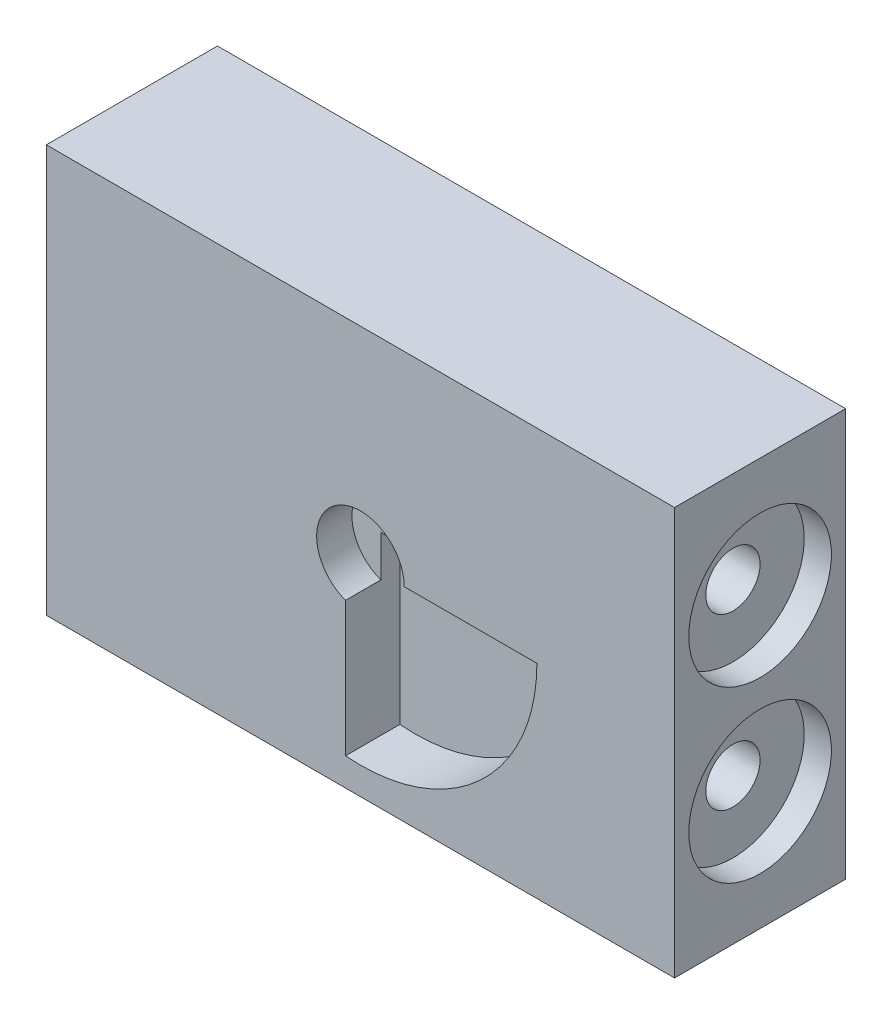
ISO-10303-21;
HEADER;
FILE_DESCRIPTION(('STEP AP214'),'2;1');
FILE_NAME('part.step','',(''),(''),'','','');
FILE_SCHEMA(('AUTOMOTIVE_DESIGN { 1 0 10303 214 1 1 1 1 }'));
ENDSEC;
DATA;
#1=APPLICATION_CONTEXT('core data for automotive mechanical design processes');
#2=APPLICATION_PROTOCOL_DEFINITION('international standard','automotive_design',2000,#1);
#3=PRODUCT_CONTEXT('',#1,'mechanical');
#4=PRODUCT('Part','Part','',(#3));
#5=PRODUCT_RELATED_PRODUCT_CATEGORY('part','',(#4));
#6=PRODUCT_DEFINITION_FORMATION('','',#4);
#7=PRODUCT_DEFINITION_CONTEXT('part definition',#1,'design');
#8=PRODUCT_DEFINITION('design','',#6,#7);
#9=PRODUCT_DEFINITION_SHAPE('','',#8);
#10=(LENGTH_UNIT() NAMED_UNIT(*) SI_UNIT(.MILLI.,.METRE.));
#11=(NAMED_UNIT(*) PLANE_ANGLE_UNIT() SI_UNIT($,.RADIAN.));
#12=(NAMED_UNIT(*) SI_UNIT($,.STERADIAN.) SOLID_ANGLE_UNIT());
#13=UNCERTAINTY_MEASURE_WITH_UNIT(LENGTH_MEASURE(1.E-05),#10,'distance_accuracy_value','');
#14=(GEOMETRIC_REPRESENTATION_CONTEXT(3) GLOBAL_UNCERTAINTY_ASSIGNED_CONTEXT((#13)) GLOBAL_UNIT_ASSIGNED_CONTEXT((#10,
#11,#12)) REPRESENTATION_CONTEXT('',''));
#15=CARTESIAN_POINT('',(0.,0.,0.));
#16=DIRECTION('',(0.,0.,1.));
#17=DIRECTION('',(1.,0.,0.));
#18=AXIS2_PLACEMENT_3D('',#15,#16,#17);
#19=CARTESIAN_POINT('',(29.5275,-16.3368181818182,0.));
#20=DIRECTION('',(1.,0.,0.));
#21=DIRECTION('',(0.,0.,-1.));
#22=AXIS2_PLACEMENT_3D('',#19,#20,#21);
#23=PLANE('',#22);
#24=CARTESIAN_POINT('',(29.5275,-15.875,0.));
#25=DIRECTION('',(-1.,0.,0.));
#26=DIRECTION('',(0.,0.,1.));
#27=AXIS2_PLACEMENT_3D('',#24,#25,#26);
#28=CIRCLE('',#27,5.08);
#29=CARTESIAN_POINT('',(29.5275,-15.875,5.08));
#30=VERTEX_POINT('',#29);
#31=EDGE_CURVE('E221',#30,#30,#28,.F.);
#32=ORIENTED_EDGE('',*,*,#31,.T.);
#33=EDGE_LOOP('',(#32));
#34=FACE_BOUND('',#33,.T.);
#35=ADVANCED_FACE('F34',(#34),#23,.T.);
#36=CARTESIAN_POINT('',(29.5275,15.4131818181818,0.));
#37=DIRECTION('',(1.,0.,0.));
#38=DIRECTION('',(0.,0.,-1.));
#39=AXIS2_PLACEMENT_3D('',#36,#37,#38);
#40=PLANE('',#39);
#41=CARTESIAN_POINT('',(29.5275,15.875,0.));
#42=DIRECTION('',(-1.,0.,0.));
#43=DIRECTION('',(0.,0.,1.));
#44=AXIS2_PLACEMENT_3D('',#41,#42,#43);
#45=CIRCLE('',#44,5.08);
#46=CARTESIAN_POINT('',(29.5275,15.875,5.08000000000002));
#47=VERTEX_POINT('',#46);
#48=EDGE_CURVE('E218',#47,#47,#45,.F.);
#49=ORIENTED_EDGE('',*,*,#48,.T.);
#50=EDGE_LOOP('',(#49));
#51=FACE_BOUND('',#50,.T.);
#52=ADVANCED_FACE('F608',(#51),#40,.T.);
#53=CARTESIAN_POINT('',(53.6575,-15.875,0.));
#54=DIRECTION('',(-1.,0.,0.));
#55=DIRECTION('',(0.,0.,1.));
#56=AXIS2_PLACEMENT_3D('',#53,#54,#55);
#57=CYLINDRICAL_SURFACE('',#56,5.08);
#58=CARTESIAN_POINT('',(53.6575,-15.875,0.));
#59=DIRECTION('',(-1.,0.,0.));
#60=DIRECTION('',(0.,0.,1.));
#61=AXIS2_PLACEMENT_3D('',#58,#59,#60);
#62=CIRCLE('',#61,5.08);
#63=CARTESIAN_POINT('',(53.6575,-15.875,5.08));
#64=VERTEX_POINT('',#63);
#65=EDGE_CURVE('E215',#64,#64,#62,.T.);
#66=ORIENTED_EDGE('',*,*,#65,.F.);
#67=EDGE_LOOP('',(#66));
#68=FACE_BOUND('',#67,.T.);
#69=ORIENTED_EDGE('',*,*,#31,.F.);
#70=EDGE_LOOP('',(#69));
#71=FACE_BOUND('',#70,.T.);
#72=ADVANCED_FACE('F618',(#68,#71),#57,.F.);
#73=CARTESIAN_POINT('',(53.6575,15.875,0.));
#74=DIRECTION('',(-1.,0.,0.));
#75=DIRECTION('',(0.,0.,1.));
#76=AXIS2_PLACEMENT_3D('',#73,#74,#75);
#77=CYLINDRICAL_SURFACE('',#76,5.08);
#78=CARTESIAN_POINT('',(53.6575,15.875,0.));
#79=DIRECTION('',(-1.,0.,0.));
#80=DIRECTION('',(0.,0.,1.));
#81=AXIS2_PLACEMENT_3D('',#78,#79,#80);
#82=CIRCLE('',#81,5.08);
#83=CARTESIAN_POINT('',(53.6575,15.875,5.08000000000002));
#84=VERTEX_POINT('',#83);
#85=EDGE_CURVE('E212',#84,#84,#82,.T.);
#86=ORIENTED_EDGE('',*,*,#85,.F.);
#87=EDGE_LOOP('',(#86));
#88=FACE_BOUND('',#87,.T.);
#89=ORIENTED_EDGE('',*,*,#48,.F.);
#90=EDGE_LOOP('',(#89));
#91=FACE_BOUND('',#90,.T.);
#92=ADVANCED_FACE('F628',(#88,#91),#77,.F.);
#93=CARTESIAN_POINT('',(-32.0397909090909,0.,-6.35));
#94=DIRECTION('',(0.,0.,1.));
#95=DIRECTION('',(1.,0.,0.));
#96=AXIS2_PLACEMENT_3D('',#93,#94,#95);
#97=PLANE('',#96);
#98=CARTESIAN_POINT('',(-31.75,0.,-6.35));
#99=DIRECTION('',(0.,0.,1.));
#100=DIRECTION('',(1.,0.,0.));
#101=AXIS2_PLACEMENT_3D('',#98,#99,#100);
#102=CIRCLE('',#101,3.1877);
#103=CARTESIAN_POINT('',(-28.5623,0.,-6.35));
#104=VERTEX_POINT('',#103);
#105=EDGE_CURVE('E209',#104,#104,#102,.F.);
#106=ORIENTED_EDGE('',*,*,#105,.T.);
#107=EDGE_LOOP('',(#106));
#108=FACE_BOUND('',#107,.T.);
#109=ADVANCED_FACE('F638',(#108),#97,.F.);
#110=CARTESIAN_POINT('',(32.0386363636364,-31.75,-5.08));
#111=DIRECTION('',(0.,0.,1.));
#112=DIRECTION('',(1.,0.,0.));
#113=AXIS2_PLACEMENT_3D('',#110,#111,#112);
#114=PLANE('',#113);
#115=CARTESIAN_POINT('',(31.75,-31.75,-5.08));
#116=DIRECTION('',(0.,0.,1.));
#117=DIRECTION('',(1.,0.,0.));
#118=AXIS2_PLACEMENT_3D('',#115,#116,#117);
#119=CIRCLE('',#118,3.175);
#120=CARTESIAN_POINT('',(34.925,-31.75,-5.08));
#121=VERTEX_POINT('',#120);
#122=EDGE_CURVE('E206',#121,#121,#119,.F.);
#123=ORIENTED_EDGE('',*,*,#122,.T.);
#124=EDGE_LOOP('',(#123));
#125=FACE_BOUND('',#124,.T.);
#126=ADVANCED_FACE('F343',(#125),#114,.F.);
#127=CARTESIAN_POINT('',(28.575,28.5115,-5.08));
#128=DIRECTION('',(0.,0.,1.));
#129=DIRECTION('',(1.,0.,0.));
#130=AXIS2_PLACEMENT_3D('',#127,#128,#129);
#131=PLANE('',#130);
#132=CARTESIAN_POINT('',(31.75,31.75,-5.08));
#133=DIRECTION('',(0.,0.,1.));
#134=DIRECTION('',(1.,0.,0.));
#135=AXIS2_PLACEMENT_3D('',#132,#133,#134);
#136=CIRCLE('',#135,3.175);
#137=CARTESIAN_POINT('',(34.925,31.75,-5.08));
#138=VERTEX_POINT('',#137);
#139=EDGE_CURVE('E203',#138,#138,#136,.F.);
#140=ORIENTED_EDGE('',*,*,#139,.T.);
#141=EDGE_LOOP('',(#140));
#142=FACE_BOUND('',#141,.T.);
#143=ADVANCED_FACE('F339',(#142),#131,.F.);
#144=CARTESIAN_POINT('',(32.0397909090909,0.,-6.35));
#145=DIRECTION('',(0.,0.,1.));
#146=DIRECTION('',(1.,0.,0.));
#147=AXIS2_PLACEMENT_3D('',#144,#145,#146);
#148=PLANE('',#147);
#149=CARTESIAN_POINT('',(31.75,0.,-6.35));
#150=DIRECTION('',(0.,0.,1.));
#151=DIRECTION('',(1.,0.,0.));
#152=AXIS2_PLACEMENT_3D('',#149,#150,#151);
#153=CIRCLE('',#152,3.1877);
#154=CARTESIAN_POINT('',(34.9377,0.,-6.35));
#155=VERTEX_POINT('',#154);
#156=EDGE_CURVE('E200',#155,#155,#153,.F.);
#157=ORIENTED_EDGE('',*,*,#156,.T.);
#158=EDGE_LOOP('',(#157));
#159=FACE_BOUND('',#158,.T.);
#160=ADVANCED_FACE('F342',(#159),#148,.F.);
#161=CARTESIAN_POINT('',(-28.575,-28.5115,-5.08));
#162=DIRECTION('',(0.,0.,1.));
#163=DIRECTION('',(-1.,0.,0.));
#164=AXIS2_PLACEMENT_3D('',#161,#162,#163);
#165=PLANE('',#164);
#166=CARTESIAN_POINT('',(-31.75,-31.75,-5.08));
#167=DIRECTION('',(0.,0.,1.));
#168=DIRECTION('',(1.,0.,0.));
#169=AXIS2_PLACEMENT_3D('',#166,#167,#168);
#170=CIRCLE('',#169,3.175);
#171=CARTESIAN_POINT('',(-28.575,-31.75,-5.08));
#172=VERTEX_POINT('',#171);
#173=EDGE_CURVE('E197',#172,#172,#170,.F.);
#174=ORIENTED_EDGE('',*,*,#173,.T.);
#175=EDGE_LOOP('',(#174));
#176=FACE_BOUND('',#175,.T.);
#177=ADVANCED_FACE('F345',(#176),#165,.F.);
#178=CARTESIAN_POINT('',(-32.0386363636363,31.75,-5.08));
#179=DIRECTION('',(0.,0.,1.));
#180=DIRECTION('',(1.,0.,0.));
#181=AXIS2_PLACEMENT_3D('',#178,#179,#180);
#182=PLANE('',#181);
#183=CARTESIAN_POINT('',(-31.75,31.75,-5.08));
#184=DIRECTION('',(0.,0.,1.));
#185=DIRECTION('',(1.,0.,0.));
#186=AXIS2_PLACEMENT_3D('',#183,#184,#185);
#187=CIRCLE('',#186,3.175);
#188=CARTESIAN_POINT('',(-28.575,31.75,-5.08));
#189=VERTEX_POINT('',#188);
#190=EDGE_CURVE('E194',#189,#189,#187,.F.);
#191=ORIENTED_EDGE('',*,*,#190,.T.);
#192=EDGE_LOOP('',(#191));
#193=FACE_BOUND('',#192,.T.);
#194=ADVANCED_FACE('F348',(#193),#182,.F.);
#195=CARTESIAN_POINT('',(53.6575,-17.0872727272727,0.));
#196=DIRECTION('',(1.,0.,0.));
#197=DIRECTION('',(0.,0.,-1.));
#198=AXIS2_PLACEMENT_3D('',#195,#196,#197);
#199=PLANE('',#198);
#200=ORIENTED_EDGE('',*,*,#65,.T.);
#201=EDGE_LOOP('',(#200));
#202=FACE_BOUND('',#201,.T.);
#203=CARTESIAN_POINT('',(53.6575,-15.875,0.));
#204=DIRECTION('',(-1.,0.,0.));
#205=DIRECTION('',(0.,0.,1.));
#206=AXIS2_PLACEMENT_3D('',#203,#204,#205);
#207=CIRCLE('',#206,13.335);
#208=CARTESIAN_POINT('',(53.6575,-15.875,13.335));
#209=VERTEX_POINT('',#208);
#210=EDGE_CURVE('E191',#209,#209,#207,.F.);
#211=ORIENTED_EDGE('',*,*,#210,.T.);
#212=EDGE_LOOP('',(#211));
#213=FACE_BOUND('',#212,.T.);
#214=ADVANCED_FACE('F672',(#202,#213),#199,.T.);
#215=CARTESIAN_POINT('',(53.6575,14.6627272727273,0.));
#216=DIRECTION('',(1.,0.,0.));
#217=DIRECTION('',(0.,0.,-1.));
#218=AXIS2_PLACEMENT_3D('',#215,#216,#217);
#219=PLANE('',#218);
#220=ORIENTED_EDGE('',*,*,#85,.T.);
#221=EDGE_LOOP('',(#220));
#222=FACE_BOUND('',#221,.T.);
#223=CARTESIAN_POINT('',(53.6575,15.875,0.));
#224=DIRECTION('',(-1.,0.,0.));
#225=DIRECTION('',(0.,0.,1.));
#226=AXIS2_PLACEMENT_3D('',#223,#224,#225);
#227=CIRCLE('',#226,13.335);
#228=CARTESIAN_POINT('',(53.6575,15.875,13.335));
#229=VERTEX_POINT('',#228);
#230=EDGE_CURVE('E188',#229,#229,#227,.F.);
#231=ORIENTED_EDGE('',*,*,#230,.T.);
#232=EDGE_LOOP('',(#231));
#233=FACE_BOUND('',#232,.T.);
#234=ADVANCED_FACE('F682',(#222,#233),#219,.T.);
#235=CARTESIAN_POINT('',(-56.7375,-18.5963723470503,0.));
#236=DIRECTION('',(1.,0.,0.));
#237=DIRECTION('',(0.,0.,-1.));
#238=AXIS2_PLACEMENT_3D('',#235,#236,#237);
#239=PLANE('',#238);
#240=CARTESIAN_POINT('',(-56.7375,-19.05,0.));
#241=DIRECTION('',(1.,0.,0.));
#242=DIRECTION('',(0.,0.,-1.));
#243=AXIS2_PLACEMENT_3D('',#240,#241,#242);
#244=CIRCLE('',#243,4.9899041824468);
#245=CARTESIAN_POINT('',(-56.7375,-19.05,-4.9899041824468));
#246=VERTEX_POINT('',#245);
#247=EDGE_CURVE('E185',#246,#246,#244,.F.);
#248=ORIENTED_EDGE('',*,*,#247,.T.);
#249=EDGE_LOOP('',(#248));
#250=FACE_BOUND('',#249,.T.);
#251=ADVANCED_FACE('F692',(#250),#239,.F.);
#252=CARTESIAN_POINT('',(-55.6895,6.75409090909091,0.));
#253=DIRECTION('',(1.,0.,0.));
#254=DIRECTION('',(0.,0.,-1.));
#255=AXIS2_PLACEMENT_3D('',#252,#253,#254);
#256=PLANE('',#255);
#257=CARTESIAN_POINT('',(-55.6895,7.11200000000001,0.));
#258=DIRECTION('',(-1.,0.,0.));
#259=DIRECTION('',(0.,0.,1.));
#260=AXIS2_PLACEMENT_3D('',#257,#258,#259);
#261=CIRCLE('',#260,3.937);
#262=CARTESIAN_POINT('',(-55.6895,7.11200000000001,3.937));
#263=VERTEX_POINT('',#262);
#264=EDGE_CURVE('E182',#263,#263,#261,.T.);
#265=ORIENTED_EDGE('',*,*,#264,.T.);
#266=EDGE_LOOP('',(#265));
#267=FACE_BOUND('',#266,.T.);
#268=ADVANCED_FACE('F702',(#267),#256,.F.);
#269=CARTESIAN_POINT('',(-55.6895,-7.46990909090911,0.));
#270=DIRECTION('',(1.,0.,0.));
#271=DIRECTION('',(0.,0.,-1.));
#272=AXIS2_PLACEMENT_3D('',#269,#270,#271);
#273=PLANE('',#272);
#274=CARTESIAN_POINT('',(-55.6895,-7.11200000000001,0.));
#275=DIRECTION('',(-1.,0.,0.));
#276=DIRECTION('',(0.,0.,1.));
#277=AXIS2_PLACEMENT_3D('',#274,#275,#276);
#278=CIRCLE('',#277,3.937);
#279=CARTESIAN_POINT('',(-55.6895,-7.11200000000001,3.937));
#280=VERTEX_POINT('',#279);
#281=EDGE_CURVE('E179',#280,#280,#278,.T.);
#282=ORIENTED_EDGE('',*,*,#281,.T.);
#283=EDGE_LOOP('',(#282));
#284=FACE_BOUND('',#283,.T.);
#285=ADVANCED_FACE('F712',(#284),#273,.F.);
#286=CARTESIAN_POINT('',(-56.1975,-32.1367727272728,7.11200000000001));
#287=DIRECTION('',(1.,0.,0.));
#288=DIRECTION('',(0.,0.,-1.));
#289=AXIS2_PLACEMENT_3D('',#286,#287,#288);
#290=PLANE('',#289);
#291=CARTESIAN_POINT('',(-56.1975,-31.75,7.11200000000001));
#292=DIRECTION('',(-1.,0.,0.));
#293=DIRECTION('',(0.,0.,1.));
#294=AXIS2_PLACEMENT_3D('',#291,#292,#293);
#295=CIRCLE('',#294,4.2545);
#296=CARTESIAN_POINT('',(-56.1975,-31.75,11.3665));
#297=VERTEX_POINT('',#296);
#298=EDGE_CURVE('E176',#297,#297,#295,.T.);
#299=ORIENTED_EDGE('',*,*,#298,.T.);
#300=EDGE_LOOP('',(#299));
#301=FACE_BOUND('',#300,.T.);
#302=ADVANCED_FACE('F354',(#301),#290,.F.);
#303=CARTESIAN_POINT('',(-56.1975,4.2545,-11.45159));
#304=DIRECTION('',(1.,0.,0.));
#305=DIRECTION('',(0.,0.,1.));
#306=AXIS2_PLACEMENT_3D('',#303,#304,#305);
#307=PLANE('',#306);
#308=CARTESIAN_POINT('',(-56.1975,0.,-7.112));
#309=DIRECTION('',(-1.,0.,0.));
#310=DIRECTION('',(0.,0.,1.));
#311=AXIS2_PLACEMENT_3D('',#308,#309,#310);
#312=CIRCLE('',#311,4.2545);
#313=CARTESIAN_POINT('',(-56.1975,0.,-2.8575));
#314=VERTEX_POINT('',#313);
#315=EDGE_CURVE('E173',#314,#314,#312,.T.);
#316=ORIENTED_EDGE('',*,*,#315,.T.);
#317=EDGE_LOOP('',(#316));
#318=FACE_BOUND('',#317,.T.);
#319=ADVANCED_FACE('F350',(#318),#307,.F.);
#320=CARTESIAN_POINT('',(-56.1975,27.4955,11.45159));
#321=DIRECTION('',(1.,0.,0.));
#322=DIRECTION('',(0.,0.,-1.));
#323=AXIS2_PLACEMENT_3D('',#320,#321,#322);
#324=PLANE('',#323);
#325=CARTESIAN_POINT('',(-56.1975,31.75,7.11200000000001));
#326=DIRECTION('',(-1.,0.,0.));
#327=DIRECTION('',(0.,0.,1.));
#328=AXIS2_PLACEMENT_3D('',#325,#326,#327);
#329=CIRCLE('',#328,4.2545);
#330=CARTESIAN_POINT('',(-56.1975,31.75,11.3665));
#331=VERTEX_POINT('',#330);
#332=EDGE_CURVE('E170',#331,#331,#329,.T.);
#333=ORIENTED_EDGE('',*,*,#332,.T.);
#334=EDGE_LOOP('',(#333));
#335=FACE_BOUND('',#334,.T.);
#336=ADVANCED_FACE('F353',(#335),#324,.F.);
#337=CARTESIAN_POINT('',(-56.1975,32.1367727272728,-7.112));
#338=DIRECTION('',(1.,0.,0.));
#339=DIRECTION('',(0.,0.,-1.));
#340=AXIS2_PLACEMENT_3D('',#337,#338,#339);
#341=PLANE('',#340);
#342=CARTESIAN_POINT('',(-56.1975,31.75,-7.112));
#343=DIRECTION('',(-1.,0.,0.));
#344=DIRECTION('',(0.,0.,1.));
#345=AXIS2_PLACEMENT_3D('',#342,#343,#344);
#346=CIRCLE('',#345,4.2545);
#347=CARTESIAN_POINT('',(-56.1975,31.75,-2.8575));
#348=VERTEX_POINT('',#347);
#349=EDGE_CURVE('E167',#348,#348,#346,.T.);
#350=ORIENTED_EDGE('',*,*,#349,.T.);
#351=EDGE_LOOP('',(#350));
#352=FACE_BOUND('',#351,.T.);
#353=ADVANCED_FACE('F358',(#352),#341,.F.);
#354=CARTESIAN_POINT('',(-56.1975,-0.386772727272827,7.112));
#355=DIRECTION('',(1.,0.,0.));
#356=DIRECTION('',(0.,0.,-1.));
#357=AXIS2_PLACEMENT_3D('',#354,#355,#356);
#358=PLANE('',#357);
#359=CARTESIAN_POINT('',(-56.1975,0.,7.112));
#360=DIRECTION('',(-1.,0.,0.));
#361=DIRECTION('',(0.,0.,1.));
#362=AXIS2_PLACEMENT_3D('',#359,#360,#361);
#363=CIRCLE('',#362,4.2545);
#364=CARTESIAN_POINT('',(-56.1975,0.,11.3665));
#365=VERTEX_POINT('',#364);
#366=EDGE_CURVE('E164',#365,#365,#363,.T.);
#367=ORIENTED_EDGE('',*,*,#366,.T.);
#368=EDGE_LOOP('',(#367));
#369=FACE_BOUND('',#368,.T.);
#370=ADVANCED_FACE('F364',(#369),#358,.F.);
#371=CARTESIAN_POINT('',(-56.1975,-27.4955,-11.45159));
#372=DIRECTION('',(1.,0.,0.));
#373=DIRECTION('',(0.,0.,1.));
#374=AXIS2_PLACEMENT_3D('',#371,#372,#373);
#375=PLANE('',#374);
#376=CARTESIAN_POINT('',(-56.1975,-31.75,-7.11200000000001));
#377=DIRECTION('',(-1.,0.,0.));
#378=DIRECTION('',(0.,0.,1.));
#379=AXIS2_PLACEMENT_3D('',#376,#377,#378);
#380=CIRCLE('',#379,4.2545);
#381=CARTESIAN_POINT('',(-56.1975,-31.75,-2.8575));
#382=VERTEX_POINT('',#381);
#383=EDGE_CURVE('E161',#382,#382,#380,.T.);
#384=ORIENTED_EDGE('',*,*,#383,.T.);
#385=EDGE_LOOP('',(#384));
#386=FACE_BOUND('',#385,.T.);
#387=ADVANCED_FACE('F360',(#386),#375,.F.);
#388=CARTESIAN_POINT('',(-31.75,0.,-16.002));
#389=DIRECTION('',(0.,0.,1.));
#390=DIRECTION('',(1.,0.,0.));
#391=AXIS2_PLACEMENT_3D('',#388,#389,#390);
#392=CYLINDRICAL_SURFACE('',#391,3.1877);
#393=ORIENTED_EDGE('',*,*,#105,.F.);
#394=EDGE_LOOP('',(#393));
#395=FACE_BOUND('',#394,.T.);
#396=CARTESIAN_POINT('',(-31.75,0.,-16.002));
#397=DIRECTION('',(0.,0.,1.));
#398=DIRECTION('',(1.,0.,0.));
#399=AXIS2_PLACEMENT_3D('',#396,#397,#398);
#400=CIRCLE('',#399,3.1877);
#401=CARTESIAN_POINT('',(-28.5623,0.,-16.002));
#402=VERTEX_POINT('',#401);
#403=EDGE_CURVE('E158',#402,#402,#400,.F.);
#404=ORIENTED_EDGE('',*,*,#403,.T.);
#405=EDGE_LOOP('',(#404));
#406=FACE_BOUND('',#405,.T.);
#407=ADVANCED_FACE('F363',(#395,#406),#392,.F.);
#408=CARTESIAN_POINT('',(31.75,-31.75,-16.002));
#409=DIRECTION('',(0.,0.,1.));
#410=DIRECTION('',(1.,0.,0.));
#411=AXIS2_PLACEMENT_3D('',#408,#409,#410);
#412=CYLINDRICAL_SURFACE('',#411,3.175);
#413=ORIENTED_EDGE('',*,*,#122,.F.);
#414=EDGE_LOOP('',(#413));
#415=FACE_BOUND('',#414,.T.);
#416=CARTESIAN_POINT('',(31.75,-31.75,-16.002));
#417=DIRECTION('',(0.,0.,1.));
#418=DIRECTION('',(1.,0.,0.));
#419=AXIS2_PLACEMENT_3D('',#416,#417,#418);
#420=CIRCLE('',#419,3.175);
#421=CARTESIAN_POINT('',(34.925,-31.75,-16.002));
#422=VERTEX_POINT('',#421);
#423=EDGE_CURVE('E155',#422,#422,#420,.F.);
#424=ORIENTED_EDGE('',*,*,#423,.T.);
#425=EDGE_LOOP('',(#424));
#426=FACE_BOUND('',#425,.T.);
#427=ADVANCED_FACE('F370',(#415,#426),#412,.F.);
#428=CARTESIAN_POINT('',(31.75,31.75,-16.002));
#429=DIRECTION('',(0.,0.,1.));
#430=DIRECTION('',(1.,0.,0.));
#431=AXIS2_PLACEMENT_3D('',#428,#429,#430);
#432=CYLINDRICAL_SURFACE('',#431,3.175);
#433=ORIENTED_EDGE('',*,*,#139,.F.);
#434=EDGE_LOOP('',(#433));
#435=FACE_BOUND('',#434,.T.);
#436=CARTESIAN_POINT('',(31.75,31.75,-16.002));
#437=DIRECTION('',(0.,0.,1.));
#438=DIRECTION('',(1.,0.,0.));
#439=AXIS2_PLACEMENT_3D('',#436,#437,#438);
#440=CIRCLE('',#439,3.175);
#441=CARTESIAN_POINT('',(34.925,31.75,-16.002));
#442=VERTEX_POINT('',#441);
#443=EDGE_CURVE('E152',#442,#442,#440,.F.);
#444=ORIENTED_EDGE('',*,*,#443,.T.);
#445=EDGE_LOOP('',(#444));
#446=FACE_BOUND('',#445,.T.);
#447=ADVANCED_FACE('F366',(#435,#446),#432,.F.);
#448=CARTESIAN_POINT('',(31.75,0.,-16.002));
#449=DIRECTION('',(0.,0.,1.));
#450=DIRECTION('',(1.,0.,0.));
#451=AXIS2_PLACEMENT_3D('',#448,#449,#450);
#452=CYLINDRICAL_SURFACE('',#451,3.1877);
#453=ORIENTED_EDGE('',*,*,#156,.F.);
#454=EDGE_LOOP('',(#453));
#455=FACE_BOUND('',#454,.T.);
#456=CARTESIAN_POINT('',(31.75,0.,-16.002));
#457=DIRECTION('',(0.,0.,1.));
#458=DIRECTION('',(1.,0.,0.));
#459=AXIS2_PLACEMENT_3D('',#456,#457,#458);
#460=CIRCLE('',#459,3.1877);
#461=CARTESIAN_POINT('',(34.9377,0.,-16.002));
#462=VERTEX_POINT('',#461);
#463=EDGE_CURVE('E149',#462,#462,#460,.F.);
#464=ORIENTED_EDGE('',*,*,#463,.T.);
#465=EDGE_LOOP('',(#464));
#466=FACE_BOUND('',#465,.T.);
#467=ADVANCED_FACE('F369',(#455,#466),#452,.F.);
#468=CARTESIAN_POINT('',(-31.75,-31.75,-16.002));
#469=DIRECTION('',(0.,0.,1.));
#470=DIRECTION('',(1.,0.,0.));
#471=AXIS2_PLACEMENT_3D('',#468,#469,#470);
#472=CYLINDRICAL_SURFACE('',#471,3.175);
#473=ORIENTED_EDGE('',*,*,#173,.F.);
#474=EDGE_LOOP('',(#473));
#475=FACE_BOUND('',#474,.T.);
#476=CARTESIAN_POINT('',(-31.75,-31.75,-16.002));
#477=DIRECTION('',(0.,0.,1.));
#478=DIRECTION('',(1.,0.,0.));
#479=AXIS2_PLACEMENT_3D('',#476,#477,#478);
#480=CIRCLE('',#479,3.175);
#481=CARTESIAN_POINT('',(-28.575,-31.75,-16.002));
#482=VERTEX_POINT('',#481);
#483=EDGE_CURVE('E146',#482,#482,#480,.F.);
#484=ORIENTED_EDGE('',*,*,#483,.T.);
#485=EDGE_LOOP('',(#484));
#486=FACE_BOUND('',#485,.T.);
#487=ADVANCED_FACE('F372',(#475,#486),#472,.F.);
#488=CARTESIAN_POINT('',(-31.75,31.75,-16.002));
#489=DIRECTION('',(0.,0.,1.));
#490=DIRECTION('',(1.,0.,0.));
#491=AXIS2_PLACEMENT_3D('',#488,#489,#490);
#492=CYLINDRICAL_SURFACE('',#491,3.175);
#493=ORIENTED_EDGE('',*,*,#190,.F.);
#494=EDGE_LOOP('',(#493));
#495=FACE_BOUND('',#494,.T.);
#496=CARTESIAN_POINT('',(-31.75,31.75,-16.002));
#497=DIRECTION('',(0.,0.,1.));
#498=DIRECTION('',(1.,0.,0.));
#499=AXIS2_PLACEMENT_3D('',#496,#497,#498);
#500=CIRCLE('',#499,3.175);
#501=CARTESIAN_POINT('',(-28.575,31.75,-16.002));
#502=VERTEX_POINT('',#501);
#503=EDGE_CURVE('E143',#502,#502,#500,.F.);
#504=ORIENTED_EDGE('',*,*,#503,.T.);
#505=EDGE_LOOP('',(#504));
#506=FACE_BOUND('',#505,.T.);
#507=ADVANCED_FACE('F375',(#495,#506),#492,.F.);
#508=CARTESIAN_POINT('',(58.7375,-15.875,0.));
#509=DIRECTION('',(-1.,0.,0.));
#510=DIRECTION('',(0.,0.,1.));
#511=AXIS2_PLACEMENT_3D('',#508,#509,#510);
#512=CYLINDRICAL_SURFACE('',#511,13.335);
#513=ORIENTED_EDGE('',*,*,#210,.F.);
#514=EDGE_LOOP('',(#513));
#515=FACE_BOUND('',#514,.T.);
#516=CARTESIAN_POINT('',(58.7375,-15.875,0.));
#517=DIRECTION('',(-1.,0.,0.));
#518=DIRECTION('',(0.,0.,1.));
#519=AXIS2_PLACEMENT_3D('',#516,#517,#518);
#520=CIRCLE('',#519,13.335);
#521=CARTESIAN_POINT('',(58.7375,-15.875,13.335));
#522=VERTEX_POINT('',#521);
#523=EDGE_CURVE('E140',#522,#522,#520,.F.);
#524=ORIENTED_EDGE('',*,*,#523,.T.);
#525=EDGE_LOOP('',(#524));
#526=FACE_BOUND('',#525,.T.);
#527=ADVANCED_FACE('F422',(#515,#526),#512,.F.);
#528=CARTESIAN_POINT('',(58.7375,15.875,0.));
#529=DIRECTION('',(-1.,0.,0.));
#530=DIRECTION('',(0.,0.,1.));
#531=AXIS2_PLACEMENT_3D('',#528,#529,#530);
#532=CYLINDRICAL_SURFACE('',#531,13.335);
#533=ORIENTED_EDGE('',*,*,#230,.F.);
#534=EDGE_LOOP('',(#533));
#535=FACE_BOUND('',#534,.T.);
#536=CARTESIAN_POINT('',(58.7375,15.875,0.));
#537=DIRECTION('',(-1.,0.,0.));
#538=DIRECTION('',(0.,0.,1.));
#539=AXIS2_PLACEMENT_3D('',#536,#537,#538);
#540=CIRCLE('',#539,13.335);
#541=CARTESIAN_POINT('',(58.7375,15.875,13.335));
#542=VERTEX_POINT('',#541);
#543=EDGE_CURVE('E137',#542,#542,#540,.F.);
#544=ORIENTED_EDGE('',*,*,#543,.T.);
#545=EDGE_LOOP('',(#544));
#546=FACE_BOUND('',#545,.T.);
#547=ADVANCED_FACE('F412',(#535,#546),#532,.F.);
#548=CARTESIAN_POINT('',(-58.7375,-19.05,0.));
#549=DIRECTION('',(1.,0.,0.));
#550=DIRECTION('',(0.,0.,-1.));
#551=AXIS2_PLACEMENT_3D('',#548,#549,#550);
#552=CYLINDRICAL_SURFACE('',#551,4.9899041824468);
#553=ORIENTED_EDGE('',*,*,#247,.F.);
#554=EDGE_LOOP('',(#553));
#555=FACE_BOUND('',#554,.T.);
#556=CARTESIAN_POINT('',(-58.7375,-19.05,0.));
#557=DIRECTION('',(1.,0.,0.));
#558=DIRECTION('',(0.,0.,-1.));
#559=AXIS2_PLACEMENT_3D('',#556,#557,#558);
#560=CIRCLE('',#559,4.9899041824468);
#561=CARTESIAN_POINT('',(-58.7375,-19.05,-4.9899041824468));
#562=VERTEX_POINT('',#561);
#563=EDGE_CURVE('E134',#562,#562,#560,.F.);
#564=ORIENTED_EDGE('',*,*,#563,.T.);
#565=EDGE_LOOP('',(#564));
#566=FACE_BOUND('',#565,.T.);
#567=ADVANCED_FACE('F409',(#555,#566),#552,.F.);
#568=CARTESIAN_POINT('',(-55.6895,7.11200000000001,0.));
#569=DIRECTION('',(-1.,0.,0.));
#570=DIRECTION('',(0.,0.,1.));
#571=AXIS2_PLACEMENT_3D('',#568,#569,#570);
#572=CYLINDRICAL_SURFACE('',#571,3.937);
#573=CARTESIAN_POINT('',(-58.7375,7.11200000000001,0.));
#574=DIRECTION('',(-1.,0.,0.));
#575=DIRECTION('',(0.,0.,1.));
#576=AXIS2_PLACEMENT_3D('',#573,#574,#575);
#577=CIRCLE('',#576,3.937);
#578=CARTESIAN_POINT('',(-58.7375,7.11200000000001,3.937));
#579=VERTEX_POINT('',#578);
#580=EDGE_CURVE('E131',#579,#579,#577,.T.);
#581=ORIENTED_EDGE('',*,*,#580,.T.);
#582=EDGE_LOOP('',(#581));
#583=FACE_BOUND('',#582,.T.);
#584=ORIENTED_EDGE('',*,*,#264,.F.);
#585=EDGE_LOOP('',(#584));
#586=FACE_BOUND('',#585,.T.);
#587=ADVANCED_FACE('F411',(#583,#586),#572,.F.);
#588=CARTESIAN_POINT('',(-55.6895,-7.11200000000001,0.));
#589=DIRECTION('',(-1.,0.,0.));
#590=DIRECTION('',(0.,0.,1.));
#591=AXIS2_PLACEMENT_3D('',#588,#589,#590);
#592=CYLINDRICAL_SURFACE('',#591,3.937);
#593=CARTESIAN_POINT('',(-58.7375,-7.11200000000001,0.));
#594=DIRECTION('',(-1.,0.,0.));
#595=DIRECTION('',(0.,0.,1.));
#596=AXIS2_PLACEMENT_3D('',#593,#594,#595);
#597=CIRCLE('',#596,3.937);
#598=CARTESIAN_POINT('',(-58.7375,-7.11200000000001,3.937));
#599=VERTEX_POINT('',#598);
#600=EDGE_CURVE('E128',#599,#599,#597,.T.);
#601=ORIENTED_EDGE('',*,*,#600,.T.);
#602=EDGE_LOOP('',(#601));
#603=FACE_BOUND('',#602,.T.);
#604=ORIENTED_EDGE('',*,*,#281,.F.);
#605=EDGE_LOOP('',(#604));
#606=FACE_BOUND('',#605,.T.);
#607=ADVANCED_FACE('F419',(#603,#606),#592,.F.);
#608=CARTESIAN_POINT('',(-56.1975,-31.75,7.11200000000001));
#609=DIRECTION('',(-1.,0.,0.));
#610=DIRECTION('',(0.,0.,1.));
#611=AXIS2_PLACEMENT_3D('',#608,#609,#610);
#612=CYLINDRICAL_SURFACE('',#611,4.2545);
#613=ORIENTED_EDGE('',*,*,#298,.F.);
#614=EDGE_LOOP('',(#613));
#615=FACE_BOUND('',#614,.T.);
#616=CARTESIAN_POINT('',(-58.7375,-31.75,7.11200000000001));
#617=DIRECTION('',(-1.,0.,0.));
#618=DIRECTION('',(0.,0.,1.));
#619=AXIS2_PLACEMENT_3D('',#616,#617,#618);
#620=CIRCLE('',#619,4.2545);
#621=CARTESIAN_POINT('',(-58.7375,-31.75,11.3665));
#622=VERTEX_POINT('',#621);
#623=EDGE_CURVE('E125',#622,#622,#620,.T.);
#624=ORIENTED_EDGE('',*,*,#623,.T.);
#625=EDGE_LOOP('',(#624));
#626=FACE_BOUND('',#625,.T.);
#627=ADVANCED_FACE('F380',(#615,#626),#612,.F.);
#628=CARTESIAN_POINT('',(-56.1975,0.,-7.112));
#629=DIRECTION('',(-1.,0.,0.));
#630=DIRECTION('',(0.,0.,1.));
#631=AXIS2_PLACEMENT_3D('',#628,#629,#630);
#632=CYLINDRICAL_SURFACE('',#631,4.2545);
#633=ORIENTED_EDGE('',*,*,#315,.F.);
#634=EDGE_LOOP('',(#633));
#635=FACE_BOUND('',#634,.T.);
#636=CARTESIAN_POINT('',(-58.7375,0.,-7.112));
#637=DIRECTION('',(-1.,0.,0.));
#638=DIRECTION('',(0.,0.,1.));
#639=AXIS2_PLACEMENT_3D('',#636,#637,#638);
#640=CIRCLE('',#639,4.2545);
#641=CARTESIAN_POINT('',(-58.7375,0.,-2.8575));
#642=VERTEX_POINT('',#641);
#643=EDGE_CURVE('E122',#642,#642,#640,.T.);
#644=ORIENTED_EDGE('',*,*,#643,.T.);
#645=EDGE_LOOP('',(#644));
#646=FACE_BOUND('',#645,.T.);
#647=ADVANCED_FACE('F377',(#635,#646),#632,.F.);
#648=CARTESIAN_POINT('',(-56.1975,31.75,7.11200000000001));
#649=DIRECTION('',(-1.,0.,0.));
#650=DIRECTION('',(0.,0.,1.));
#651=AXIS2_PLACEMENT_3D('',#648,#649,#650);
#652=CYLINDRICAL_SURFACE('',#651,4.2545);
#653=ORIENTED_EDGE('',*,*,#332,.F.);
#654=EDGE_LOOP('',(#653));
#655=FACE_BOUND('',#654,.T.);
#656=CARTESIAN_POINT('',(-58.7375,31.75,7.11200000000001));
#657=DIRECTION('',(-1.,0.,0.));
#658=DIRECTION('',(0.,0.,1.));
#659=AXIS2_PLACEMENT_3D('',#656,#657,#658);
#660=CIRCLE('',#659,4.2545);
#661=CARTESIAN_POINT('',(-58.7375,31.75,11.3665));
#662=VERTEX_POINT('',#661);
#663=EDGE_CURVE('E119',#662,#662,#660,.T.);
#664=ORIENTED_EDGE('',*,*,#663,.T.);
#665=EDGE_LOOP('',(#664));
#666=FACE_BOUND('',#665,.T.);
#667=ADVANCED_FACE('F379',(#655,#666),#652,.F.);
#668=CARTESIAN_POINT('',(-56.1975,31.75,-7.112));
#669=DIRECTION('',(-1.,0.,0.));
#670=DIRECTION('',(0.,0.,1.));
#671=AXIS2_PLACEMENT_3D('',#668,#669,#670);
#672=CYLINDRICAL_SURFACE('',#671,4.2545);
#673=ORIENTED_EDGE('',*,*,#349,.F.);
#674=EDGE_LOOP('',(#673));
#675=FACE_BOUND('',#674,.T.);
#676=CARTESIAN_POINT('',(-58.7375,31.75,-7.112));
#677=DIRECTION('',(-1.,0.,0.));
#678=DIRECTION('',(0.,0.,1.));
#679=AXIS2_PLACEMENT_3D('',#676,#677,#678);
#680=CIRCLE('',#679,4.2545);
#681=CARTESIAN_POINT('',(-58.7375,31.75,-2.8575));
#682=VERTEX_POINT('',#681);
#683=EDGE_CURVE('E116',#682,#682,#680,.T.);
#684=ORIENTED_EDGE('',*,*,#683,.T.);
#685=EDGE_LOOP('',(#684));
#686=FACE_BOUND('',#685,.T.);
#687=ADVANCED_FACE('F383',(#675,#686),#672,.F.);
#688=CARTESIAN_POINT('',(-56.1975,0.,7.112));
#689=DIRECTION('',(-1.,0.,0.));
#690=DIRECTION('',(0.,0.,1.));
#691=AXIS2_PLACEMENT_3D('',#688,#689,#690);
#692=CYLINDRICAL_SURFACE('',#691,4.2545);
#693=ORIENTED_EDGE('',*,*,#366,.F.);
#694=EDGE_LOOP('',(#693));
#695=FACE_BOUND('',#694,.T.);
#696=CARTESIAN_POINT('',(-58.7375,0.,7.112));
#697=DIRECTION('',(-1.,0.,0.));
#698=DIRECTION('',(0.,0.,1.));
#699=AXIS2_PLACEMENT_3D('',#696,#697,#698);
#700=CIRCLE('',#699,4.2545);
#701=CARTESIAN_POINT('',(-58.7375,0.,11.3665));
#702=VERTEX_POINT('',#701);
#703=EDGE_CURVE('E113',#702,#702,#700,.T.);
#704=ORIENTED_EDGE('',*,*,#703,.T.);
#705=EDGE_LOOP('',(#704));
#706=FACE_BOUND('',#705,.T.);
#707=ADVANCED_FACE('F388',(#695,#706),#692,.F.);
#708=CARTESIAN_POINT('',(-56.1975,-31.75,-7.11200000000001));
#709=DIRECTION('',(-1.,0.,0.));
#710=DIRECTION('',(0.,0.,1.));
#711=AXIS2_PLACEMENT_3D('',#708,#709,#710);
#712=CYLINDRICAL_SURFACE('',#711,4.2545);
#713=ORIENTED_EDGE('',*,*,#383,.F.);
#714=EDGE_LOOP('',(#713));
#715=FACE_BOUND('',#714,.T.);
#716=CARTESIAN_POINT('',(-58.7375,-31.75,-7.112));
#717=DIRECTION('',(-1.,0.,0.));
#718=DIRECTION('',(0.,0.,1.));
#719=AXIS2_PLACEMENT_3D('',#716,#717,#718);
#720=CIRCLE('',#719,4.2545);
#721=CARTESIAN_POINT('',(-58.7375,-31.75,-2.8575));
#722=VERTEX_POINT('',#721);
#723=EDGE_CURVE('E109',#722,#722,#720,.T.);
#724=ORIENTED_EDGE('',*,*,#723,.T.);
#725=EDGE_LOOP('',(#724));
#726=FACE_BOUND('',#725,.T.);
#727=ADVANCED_FACE('F36',(#715,#726),#712,.F.);
#728=CARTESIAN_POINT('',(0.,0.,-16.002));
#729=DIRECTION('',(0.,0.,1.));
#730=DIRECTION('',(1.,0.,0.));
#731=AXIS2_PLACEMENT_3D('',#728,#729,#730);
#732=PLANE('',#731);
#733=ORIENTED_EDGE('',*,*,#503,.F.);
#734=EDGE_LOOP('',(#733));
#735=FACE_BOUND('',#734,.T.);
#736=ORIENTED_EDGE('',*,*,#483,.F.);
#737=EDGE_LOOP('',(#736));
#738=FACE_BOUND('',#737,.T.);
#739=ORIENTED_EDGE('',*,*,#463,.F.);
#740=EDGE_LOOP('',(#739));
#741=FACE_BOUND('',#740,.T.);
#742=ORIENTED_EDGE('',*,*,#443,.F.);
#743=EDGE_LOOP('',(#742));
#744=FACE_BOUND('',#743,.T.);
#745=ORIENTED_EDGE('',*,*,#423,.F.);
#746=EDGE_LOOP('',(#745));
#747=FACE_BOUND('',#746,.T.);
#748=ORIENTED_EDGE('',*,*,#403,.F.);
#749=EDGE_LOOP('',(#748));
#750=FACE_BOUND('',#749,.T.);
#751=DIRECTION('',(1.,0.,0.));
#752=VECTOR('',#751,1.);
#753=CARTESIAN_POINT('',(0.,-38.1,-16.002));
#754=LINE('',#753,#752);
#755=CARTESIAN_POINT('',(58.7375,-38.1,-16.002));
#756=VERTEX_POINT('',#755);
#757=CARTESIAN_POINT('',(-58.7375,-38.1,-16.002));
#758=VERTEX_POINT('',#757);
#759=EDGE_CURVE('E280',#756,#758,#754,.F.);
#760=ORIENTED_EDGE('',*,*,#759,.T.);
#761=DIRECTION('',(0.,1.,0.));
#762=VECTOR('',#761,1.);
#763=CARTESIAN_POINT('',(-58.7375,0.,-16.002));
#764=LINE('',#763,#762);
#765=CARTESIAN_POINT('',(-58.7375,38.1,-16.002));
#766=VERTEX_POINT('',#765);
#767=EDGE_CURVE('E93',#758,#766,#764,.T.);
#768=ORIENTED_EDGE('',*,*,#767,.T.);
#769=DIRECTION('',(1.,0.,0.));
#770=VECTOR('',#769,1.);
#771=CARTESIAN_POINT('',(0.,38.1,-16.002));
#772=LINE('',#771,#770);
#773=CARTESIAN_POINT('',(58.7375,38.1,-16.002));
#774=VERTEX_POINT('',#773);
#775=EDGE_CURVE('E94',#766,#774,#772,.T.);
#776=ORIENTED_EDGE('',*,*,#775,.T.);
#777=DIRECTION('',(0.,1.,0.));
#778=VECTOR('',#777,1.);
#779=CARTESIAN_POINT('',(58.7375,0.,-16.002));
#780=LINE('',#779,#778);
#781=EDGE_CURVE('E89',#774,#756,#780,.F.);
#782=ORIENTED_EDGE('',*,*,#781,.T.);
#783=EDGE_LOOP('',(#760,#768,#776,#782));
#784=FACE_BOUND('',#783,.T.);
#785=ADVANCED_FACE('F289',(#735,#738,#741,#744,#747,#750,#784),#732,.F.);
#786=CARTESIAN_POINT('',(58.7375,0.,0.));
#787=DIRECTION('',(-1.,0.,0.));
#788=DIRECTION('',(0.,0.,1.));
#789=AXIS2_PLACEMENT_3D('',#786,#787,#788);
#790=PLANE('',#789);
#791=ORIENTED_EDGE('',*,*,#543,.F.);
#792=EDGE_LOOP('',(#791));
#793=FACE_BOUND('',#792,.T.);
#794=ORIENTED_EDGE('',*,*,#523,.F.);
#795=EDGE_LOOP('',(#794));
#796=FACE_BOUND('',#795,.T.);
#797=ORIENTED_EDGE('',*,*,#781,.F.);
#798=DIRECTION('',(0.,0.,-1.));
#799=VECTOR('',#798,1.);
#800=CARTESIAN_POINT('',(58.7375,38.1,0.));
#801=LINE('',#800,#799);
#802=CARTESIAN_POINT('',(58.7375,38.1,16.002));
#803=VERTEX_POINT('',#802);
#804=EDGE_CURVE('E85',#774,#803,#801,.F.);
#805=ORIENTED_EDGE('',*,*,#804,.T.);
#806=DIRECTION('',(0.,1.,0.));
#807=VECTOR('',#806,1.);
#808=CARTESIAN_POINT('',(58.7375,0.,16.002));
#809=LINE('',#808,#807);
#810=CARTESIAN_POINT('',(58.7375,-38.1,16.002));
#811=VERTEX_POINT('',#810);
#812=EDGE_CURVE('E71',#811,#803,#809,.T.);
#813=ORIENTED_EDGE('',*,*,#812,.F.);
#814=DIRECTION('',(0.,0.,1.));
#815=VECTOR('',#814,1.);
#816=CARTESIAN_POINT('',(58.7375,-38.1,0.));
#817=LINE('',#816,#815);
#818=EDGE_CURVE('E112',#811,#756,#817,.F.);
#819=ORIENTED_EDGE('',*,*,#818,.T.);
#820=EDGE_LOOP('',(#797,#805,#813,#819));
#821=FACE_BOUND('',#820,.T.);
#822=ADVANCED_FACE('F86',(#793,#796,#821),#790,.F.);
#823=CARTESIAN_POINT('',(0.,38.1,0.));
#824=DIRECTION('',(0.,-1.,0.));
#825=DIRECTION('',(0.,0.,-1.));
#826=AXIS2_PLACEMENT_3D('',#823,#824,#825);
#827=PLANE('',#826);
#828=ORIENTED_EDGE('',*,*,#775,.F.);
#829=DIRECTION('',(0.,0.,-1.));
#830=VECTOR('',#829,1.);
#831=CARTESIAN_POINT('',(-58.7375,38.1,0.));
#832=LINE('',#831,#830);
#833=CARTESIAN_POINT('',(-58.7375,38.1,16.002));
#834=VERTEX_POINT('',#833);
#835=EDGE_CURVE('E98',#766,#834,#832,.F.);
#836=ORIENTED_EDGE('',*,*,#835,.T.);
#837=DIRECTION('',(1.,0.,0.));
#838=VECTOR('',#837,1.);
#839=CARTESIAN_POINT('',(0.,38.1,16.002));
#840=LINE('',#839,#838);
#841=EDGE_CURVE('E75',#803,#834,#840,.F.);
#842=ORIENTED_EDGE('',*,*,#841,.F.);
#843=ORIENTED_EDGE('',*,*,#804,.F.);
#844=EDGE_LOOP('',(#828,#836,#842,#843));
#845=FACE_BOUND('',#844,.T.);
#846=ADVANCED_FACE('F96',(#845),#827,.F.);
#847=CARTESIAN_POINT('',(-58.7375,0.,0.));
#848=DIRECTION('',(1.,0.,0.));
#849=DIRECTION('',(0.,0.,-1.));
#850=AXIS2_PLACEMENT_3D('',#847,#848,#849);
#851=PLANE('',#850);
#852=ORIENTED_EDGE('',*,*,#723,.F.);
#853=EDGE_LOOP('',(#852));
#854=FACE_BOUND('',#853,.T.);
#855=ORIENTED_EDGE('',*,*,#703,.F.);
#856=EDGE_LOOP('',(#855));
#857=FACE_BOUND('',#856,.T.);
#858=ORIENTED_EDGE('',*,*,#683,.F.);
#859=EDGE_LOOP('',(#858));
#860=FACE_BOUND('',#859,.T.);
#861=ORIENTED_EDGE('',*,*,#663,.F.);
#862=EDGE_LOOP('',(#861));
#863=FACE_BOUND('',#862,.T.);
#864=ORIENTED_EDGE('',*,*,#643,.F.);
#865=EDGE_LOOP('',(#864));
#866=FACE_BOUND('',#865,.T.);
#867=ORIENTED_EDGE('',*,*,#623,.F.);
#868=EDGE_LOOP('',(#867));
#869=FACE_BOUND('',#868,.T.);
#870=ORIENTED_EDGE('',*,*,#600,.F.);
#871=EDGE_LOOP('',(#870));
#872=FACE_BOUND('',#871,.T.);
#873=ORIENTED_EDGE('',*,*,#580,.F.);
#874=EDGE_LOOP('',(#873));
#875=FACE_BOUND('',#874,.T.);
#876=ORIENTED_EDGE('',*,*,#563,.F.);
#877=EDGE_LOOP('',(#876));
#878=FACE_BOUND('',#877,.T.);
#879=ORIENTED_EDGE('',*,*,#767,.F.);
#880=DIRECTION('',(0.,0.,1.));
#881=VECTOR('',#880,1.);
#882=CARTESIAN_POINT('',(-58.7375,-38.1,0.));
#883=LINE('',#882,#881);
#884=CARTESIAN_POINT('',(-58.7375,-38.1,16.002));
#885=VERTEX_POINT('',#884);
#886=EDGE_CURVE('E81',#758,#885,#883,.T.);
#887=ORIENTED_EDGE('',*,*,#886,.T.);
#888=DIRECTION('',(0.,1.,0.));
#889=VECTOR('',#888,1.);
#890=CARTESIAN_POINT('',(-58.7375,0.,16.002));
#891=LINE('',#890,#889);
#892=EDGE_CURVE('E58',#834,#885,#891,.F.);
#893=ORIENTED_EDGE('',*,*,#892,.F.);
#894=ORIENTED_EDGE('',*,*,#835,.F.);
#895=EDGE_LOOP('',(#879,#887,#893,#894));
#896=FACE_BOUND('',#895,.T.);
#897=ADVANCED_FACE('F330',(#854,#857,#860,#863,#866,#869,#872,#875,#878,#896),#851,.F.);
#898=CARTESIAN_POINT('',(0.,-38.1,0.));
#899=DIRECTION('',(0.,1.,0.));
#900=DIRECTION('',(0.,0.,1.));
#901=AXIS2_PLACEMENT_3D('',#898,#899,#900);
#902=PLANE('',#901);
#903=ORIENTED_EDGE('',*,*,#759,.F.);
#904=ORIENTED_EDGE('',*,*,#818,.F.);
#905=DIRECTION('',(1.,0.,0.));
#906=VECTOR('',#905,1.);
#907=CARTESIAN_POINT('',(0.,-38.1,16.002));
#908=LINE('',#907,#906);
#909=EDGE_CURVE('E78',#885,#811,#908,.T.);
#910=ORIENTED_EDGE('',*,*,#909,.F.);
#911=ORIENTED_EDGE('',*,*,#886,.F.);
#912=EDGE_LOOP('',(#903,#904,#910,#911));
#913=FACE_BOUND('',#912,.T.);
#914=ADVANCED_FACE('F286',(#913),#902,.F.);
#915=CARTESIAN_POINT('',(0.744681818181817,0.,9.39800000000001));
#916=DIRECTION('',(0.,0.,1.));
#917=DIRECTION('',(1.,0.,0.));
#918=AXIS2_PLACEMENT_3D('',#915,#916,#917);
#919=PLANE('',#918);
#920=DIRECTION('',(0.,-1.,0.));
#921=VECTOR('',#920,1.);
#922=CARTESIAN_POINT('',(-2.794,0.,9.39800000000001));
#923=LINE('',#922,#921);
#924=CARTESIAN_POINT('',(-2.794,0.,9.39800000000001));
#925=VERTEX_POINT('',#924);
#926=CARTESIAN_POINT('',(-2.794,-7.7002750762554,9.39800000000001));
#927=VERTEX_POINT('',#926);
#928=EDGE_CURVE('E229',#925,#927,#923,.T.);
#929=ORIENTED_EDGE('',*,*,#928,.F.);
#930=DIRECTION('',(-1.,0.,0.));
#931=VECTOR('',#930,1.);
#932=CARTESIAN_POINT('',(0.744681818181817,0.,9.39800000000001));
#933=LINE('',#932,#931);
#934=CARTESIAN_POINT('',(8.19149999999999,0.,9.39800000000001));
#935=VERTEX_POINT('',#934);
#936=EDGE_CURVE('E264',#935,#925,#933,.T.);
#937=ORIENTED_EDGE('',*,*,#936,.F.);
#938=CARTESIAN_POINT('',(0.,0.,9.39800000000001));
#939=DIRECTION('',(0.,0.,1.));
#940=DIRECTION('',(1.,0.,0.));
#941=AXIS2_PLACEMENT_3D('',#938,#939,#940);
#942=CIRCLE('',#941,8.19149999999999);
#943=EDGE_CURVE('E106',#935,#927,#942,.T.);
#944=ORIENTED_EDGE('',*,*,#943,.T.);
#945=EDGE_LOOP('',(#929,#937,#944));
#946=FACE_BOUND('',#945,.T.);
#947=ADVANCED_FACE('F322',(#946),#919,.T.);
#948=CARTESIAN_POINT('',(0.,0.,16.002));
#949=DIRECTION('',(0.,0.,1.));
#950=DIRECTION('',(1.,0.,0.));
#951=AXIS2_PLACEMENT_3D('',#948,#949,#950);
#952=PLANE('',#951);
#953=DIRECTION('',(0.,-1.,0.));
#954=VECTOR('',#953,1.);
#955=CARTESIAN_POINT('',(-2.794,0.,16.002));
#956=LINE('',#955,#954);
#957=CARTESIAN_POINT('',(-2.794,-7.7002750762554,16.002));
#958=VERTEX_POINT('',#957);
#959=CARTESIAN_POINT('',(-2.794,-32.881913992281,16.002));
#960=VERTEX_POINT('',#959);
#961=EDGE_CURVE('E243',#958,#960,#956,.T.);
#962=ORIENTED_EDGE('',*,*,#961,.F.);
#963=CARTESIAN_POINT('',(0.,0.,16.002));
#964=DIRECTION('',(0.,0.,1.));
#965=DIRECTION('',(1.,0.,0.));
#966=AXIS2_PLACEMENT_3D('',#963,#964,#965);
#967=CIRCLE('',#966,8.19149999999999);
#968=CARTESIAN_POINT('',(8.19149999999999,0.,16.002));
#969=VERTEX_POINT('',#968);
#970=EDGE_CURVE('E103',#958,#969,#967,.F.);
#971=ORIENTED_EDGE('',*,*,#970,.T.);
#972=DIRECTION('',(-1.,0.,0.));
#973=VECTOR('',#972,1.);
#974=CARTESIAN_POINT('',(-2.794,0.,16.002));
#975=LINE('',#974,#973);
#976=CARTESIAN_POINT('',(33.0004046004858,0.,16.002));
#977=VERTEX_POINT('',#976);
#978=EDGE_CURVE('E49',#977,#969,#975,.T.);
#979=ORIENTED_EDGE('',*,*,#978,.F.);
#980=CARTESIAN_POINT('',(0.,0.,16.002));
#981=DIRECTION('',(0.,0.,1.));
#982=DIRECTION('',(1.,0.,0.));
#983=AXIS2_PLACEMENT_3D('',#980,#981,#982);
#984=CIRCLE('',#983,33.0004046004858);
#985=EDGE_CURVE('E246',#960,#977,#984,.T.);
#986=ORIENTED_EDGE('',*,*,#985,.F.);
#987=EDGE_LOOP('',(#962,#971,#979,#986));
#988=FACE_BOUND('',#987,.T.);
#989=ORIENTED_EDGE('',*,*,#892,.T.);
#990=ORIENTED_EDGE('',*,*,#909,.T.);
#991=ORIENTED_EDGE('',*,*,#812,.T.);
#992=ORIENTED_EDGE('',*,*,#841,.T.);
#993=EDGE_LOOP('',(#989,#990,#991,#992));
#994=FACE_BOUND('',#993,.T.);
#995=ADVANCED_FACE('F73',(#988,#994),#952,.T.);
#996=CARTESIAN_POINT('',(0.,0.,9.39800000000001));
#997=DIRECTION('',(0.,0.,1.));
#998=DIRECTION('',(1.,0.,0.));
#999=AXIS2_PLACEMENT_3D('',#996,#997,#998);
#1000=CYLINDRICAL_SURFACE('',#999,8.19149999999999);
#1001=ORIENTED_EDGE('',*,*,#970,.F.);
#1002=DIRECTION('',(0.,0.,1.));
#1003=VECTOR('',#1002,1.);
#1004=CARTESIAN_POINT('',(-2.794,-7.7002750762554,9.39800000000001));
#1005=LINE('',#1004,#1003);
#1006=EDGE_CURVE('E11',#958,#927,#1005,.F.);
#1007=ORIENTED_EDGE('',*,*,#1006,.T.);
#1008=ORIENTED_EDGE('',*,*,#943,.F.);
#1009=DIRECTION('',(0.,0.,1.));
#1010=VECTOR('',#1009,1.);
#1011=CARTESIAN_POINT('',(8.19149999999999,0.,9.39800000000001));
#1012=LINE('',#1011,#1010);
#1013=EDGE_CURVE('E42',#935,#969,#1012,.T.);
#1014=ORIENTED_EDGE('',*,*,#1013,.T.);
#1015=EDGE_LOOP('',(#1001,#1007,#1008,#1014));
#1016=FACE_BOUND('',#1015,.T.);
#1017=ADVANCED_FACE('F233',(#1016),#1000,.F.);
#1018=CARTESIAN_POINT('',(0.,0.,5.842));
#1019=DIRECTION('',(0.,0.,1.));
#1020=DIRECTION('',(1.,0.,0.));
#1021=AXIS2_PLACEMENT_3D('',#1018,#1019,#1020);
#1022=CYLINDRICAL_SURFACE('',#1021,33.0004046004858);
#1023=ORIENTED_EDGE('',*,*,#985,.T.);
#1024=DIRECTION('',(0.,0.,1.));
#1025=VECTOR('',#1024,1.);
#1026=CARTESIAN_POINT('',(33.0004046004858,0.,5.842));
#1027=LINE('',#1026,#1025);
#1028=CARTESIAN_POINT('',(33.0004046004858,0.,5.842));
#1029=VERTEX_POINT('',#1028);
#1030=EDGE_CURVE('E268',#1029,#977,#1027,.T.);
#1031=ORIENTED_EDGE('',*,*,#1030,.F.);
#1032=CARTESIAN_POINT('',(0.,0.,5.842));
#1033=DIRECTION('',(0.,0.,1.));
#1034=DIRECTION('',(1.,0.,0.));
#1035=AXIS2_PLACEMENT_3D('',#1032,#1033,#1034);
#1036=CIRCLE('',#1035,33.0004046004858);
#1037=CARTESIAN_POINT('',(-2.794,-32.881913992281,5.842));
#1038=VERTEX_POINT('',#1037);
#1039=EDGE_CURVE('E254',#1038,#1029,#1036,.T.);
#1040=ORIENTED_EDGE('',*,*,#1039,.F.);
#1041=DIRECTION('',(0.,0.,1.));
#1042=VECTOR('',#1041,1.);
#1043=CARTESIAN_POINT('',(-2.794,-32.881913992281,5.842));
#1044=LINE('',#1043,#1042);
#1045=EDGE_CURVE('E262',#1038,#960,#1044,.T.);
#1046=ORIENTED_EDGE('',*,*,#1045,.T.);
#1047=EDGE_LOOP('',(#1023,#1031,#1040,#1046));
#1048=FACE_BOUND('',#1047,.T.);
#1049=ADVANCED_FACE('F310',(#1048),#1022,.F.);
#1050=CARTESIAN_POINT('',(-2.794,0.,5.842));
#1051=DIRECTION('',(-1.,0.,0.));
#1052=DIRECTION('',(0.,-1.,0.));
#1053=AXIS2_PLACEMENT_3D('',#1050,#1051,#1052);
#1054=PLANE('',#1053);
#1055=ORIENTED_EDGE('',*,*,#928,.T.);
#1056=ORIENTED_EDGE('',*,*,#1006,.F.);
#1057=ORIENTED_EDGE('',*,*,#961,.T.);
#1058=ORIENTED_EDGE('',*,*,#1045,.F.);
#1059=DIRECTION('',(0.,-1.,0.));
#1060=VECTOR('',#1059,1.);
#1061=CARTESIAN_POINT('',(-2.794,0.,5.842));
#1062=LINE('',#1061,#1060);
#1063=CARTESIAN_POINT('',(-2.794,0.,5.842));
#1064=VERTEX_POINT('',#1063);
#1065=EDGE_CURVE('E270',#1064,#1038,#1062,.T.);
#1066=ORIENTED_EDGE('',*,*,#1065,.F.);
#1067=DIRECTION('',(0.,0.,1.));
#1068=VECTOR('',#1067,1.);
#1069=CARTESIAN_POINT('',(-2.794,0.,5.842));
#1070=LINE('',#1069,#1068);
#1071=EDGE_CURVE('E265',#1064,#925,#1070,.T.);
#1072=ORIENTED_EDGE('',*,*,#1071,.T.);
#1073=EDGE_LOOP('',(#1055,#1056,#1057,#1058,#1066,#1072));
#1074=FACE_BOUND('',#1073,.T.);
#1075=ADVANCED_FACE('F319',(#1074),#1054,.F.);
#1076=CARTESIAN_POINT('',(-2.794,0.,5.842));
#1077=DIRECTION('',(0.,1.,0.));
#1078=DIRECTION('',(-1.,0.,0.));
#1079=AXIS2_PLACEMENT_3D('',#1076,#1077,#1078);
#1080=PLANE('',#1079);
#1081=ORIENTED_EDGE('',*,*,#936,.T.);
#1082=ORIENTED_EDGE('',*,*,#1071,.F.);
#1083=DIRECTION('',(-1.,0.,0.));
#1084=VECTOR('',#1083,1.);
#1085=CARTESIAN_POINT('',(-2.794,0.,5.842));
#1086=LINE('',#1085,#1084);
#1087=EDGE_CURVE('E257',#1029,#1064,#1086,.T.);
#1088=ORIENTED_EDGE('',*,*,#1087,.F.);
#1089=ORIENTED_EDGE('',*,*,#1030,.T.);
#1090=ORIENTED_EDGE('',*,*,#978,.T.);
#1091=ORIENTED_EDGE('',*,*,#1013,.F.);
#1092=EDGE_LOOP('',(#1081,#1082,#1088,#1089,#1090,#1091));
#1093=FACE_BOUND('',#1092,.T.);
#1094=ADVANCED_FACE('F313',(#1093),#1080,.F.);
#1095=CARTESIAN_POINT('',(0.,0.,5.842));
#1096=DIRECTION('',(0.,0.,1.));
#1097=DIRECTION('',(1.,0.,0.));
#1098=AXIS2_PLACEMENT_3D('',#1095,#1096,#1097);
#1099=PLANE('',#1098);
#1100=ORIENTED_EDGE('',*,*,#1039,.T.);
#1101=ORIENTED_EDGE('',*,*,#1087,.T.);
#1102=ORIENTED_EDGE('',*,*,#1065,.T.);
#1103=EDGE_LOOP('',(#1100,#1101,#1102));
#1104=FACE_BOUND('',#1103,.T.);
#1105=ADVANCED_FACE('F317',(#1104),#1099,.T.);
#1106=CLOSED_SHELL('',(#35,#52,#72,#92,#109,#126,#143,#160,#177,#194,#214,#234,#251,#268,#285,
#302,#319,#336,#353,#370,#387,#407,#427,#447,#467,#487,#507,#527,#547,#567,#587,#607,#627,#647,
#667,#687,#707,#727,#785,#822,#846,#897,#914,#947,#995,#1017,#1049,#1075,#1094,#1105));
#1107=CARTESIAN_POINT('',(-55.785,19.5036276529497,0.));
#1108=DIRECTION('',(1.,0.,0.));
#1109=DIRECTION('',(0.,0.,-1.));
#1110=AXIS2_PLACEMENT_3D('',#1107,#1108,#1109);
#1111=PLANE('',#1110);
#1112=CARTESIAN_POINT('',(-55.785,19.05,0.));
#1113=DIRECTION('',(1.,0.,0.));
#1114=DIRECTION('',(0.,0.,-1.));
#1115=AXIS2_PLACEMENT_3D('',#1112,#1113,#1114);
#1116=CIRCLE('',#1115,4.9899041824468);
#1117=CARTESIAN_POINT('',(-55.785,19.05,-4.9899041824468));
#1118=VERTEX_POINT('',#1117);
#1119=EDGE_CURVE('E227',#1118,#1118,#1116,.T.);
#1120=ORIENTED_EDGE('',*,*,#1119,.F.);
#1121=EDGE_LOOP('',(#1120));
#1122=FACE_BOUND('',#1121,.T.);
#1123=ADVANCED_FACE('F574',(#1122),#1111,.F.);
#1124=CARTESIAN_POINT('',(-57.785,19.05,0.));
#1125=DIRECTION('',(1.,0.,0.));
#1126=DIRECTION('',(0.,0.,-1.));
#1127=AXIS2_PLACEMENT_3D('',#1124,#1125,#1126);
#1128=CYLINDRICAL_SURFACE('',#1127,4.9899041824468);
#1129=ORIENTED_EDGE('',*,*,#1119,.T.);
#1130=EDGE_LOOP('',(#1129));
#1131=FACE_BOUND('',#1130,.T.);
#1132=CARTESIAN_POINT('',(-57.785,19.05,0.));
#1133=DIRECTION('',(1.,0.,0.));
#1134=DIRECTION('',(0.,0.,-1.));
#1135=AXIS2_PLACEMENT_3D('',#1132,#1133,#1134);
#1136=CIRCLE('',#1135,4.9899041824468);
#1137=CARTESIAN_POINT('',(-57.785,19.05,-4.9899041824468));
#1138=VERTEX_POINT('',#1137);
#1139=EDGE_CURVE('E224',#1138,#1138,#1136,.F.);
#1140=ORIENTED_EDGE('',*,*,#1139,.T.);
#1141=EDGE_LOOP('',(#1140));
#1142=FACE_BOUND('',#1141,.T.);
#1143=ADVANCED_FACE('F578',(#1131,#1142),#1128,.F.);
#1144=CARTESIAN_POINT('',(-57.785,19.5036276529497,0.));
#1145=DIRECTION('',(1.,0.,0.));
#1146=DIRECTION('',(0.,0.,-1.));
#1147=AXIS2_PLACEMENT_3D('',#1144,#1145,#1146);
#1148=PLANE('',#1147);
#1149=ORIENTED_EDGE('',*,*,#1139,.F.);
#1150=EDGE_LOOP('',(#1149));
#1151=FACE_BOUND('',#1150,.T.);
#1152=ADVANCED_FACE('F588',(#1151),#1148,.T.);
#1153=CLOSED_SHELL('',(#1123,#1143,#1152));
#1154=ORIENTED_CLOSED_SHELL('',*,#1153,.T.);
#1155=BREP_WITH_VOIDS('B2',#1106,(#1154));
#1156=ADVANCED_BREP_SHAPE_REPRESENTATION('',(#18,#1155),#14);
#1157=SHAPE_DEFINITION_REPRESENTATION(#9,#1156);
ENDSEC;
END-ISO-10303-21;
